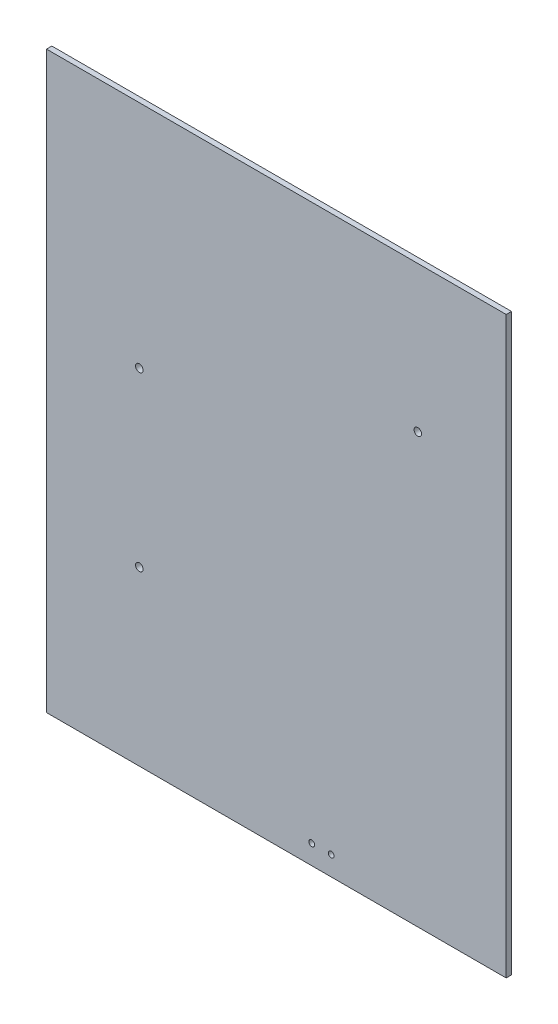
from build123d import *

# Parameters (mm, degrees)
ESQUISSE1_W             = 520
ESQUISSE1_H             = 650
BASE_EXTRUSION_DEPTH    = 6
ENL_V_MAT_EXTRU_1_REACH = 834.428
ESQUISSE2_R             = 4.25
ENL_V_MAT_EXTRU_2_REACH = 834.428
ESQUISSE3_R             = 3.25


with BuildPart() as part:
    # Esquisse1 → Base-Extrusion (new body)
    with BuildSketch(Plane.XY):
        with Locations((260, 325)):
            Rectangle(ESQUISSE1_W, ESQUISSE1_H)
    extrude(amount=BASE_EXTRUSION_DEPTH)

    # Esquisse2 → Enl_v. mat.-Extru.1 (cut, up to next)
    with BuildSketch(Plane.XY.offset(6), mode=Mode.PRIVATE) as enl_v_mat_extru_1_sk1:
        with Locations((420, 485)):
            Circle(ESQUISSE2_R)
    enl_v_mat_extru_1_tool1 = extrude(enl_v_mat_extru_1_sk1.sketch, amount=-ENL_V_MAT_EXTRU_1_REACH, mode=Mode.PRIVATE) & part.part
    # Esquisse2 → Enl_v. mat.-Extru.1 (cut, up to next)
    with BuildSketch(Plane.XY.offset(6), mode=Mode.PRIVATE) as enl_v_mat_extru_1_sk2:
        with Locations((105, 390)):
            Circle(ESQUISSE2_R)
    enl_v_mat_extru_1_tool2 = extrude(enl_v_mat_extru_1_sk2.sketch, amount=-ENL_V_MAT_EXTRU_1_REACH, mode=Mode.PRIVATE) & part.part
    # Esquisse2 → Enl_v. mat.-Extru.1 (cut, up to next)
    with BuildSketch(Plane.XY.offset(6), mode=Mode.PRIVATE) as enl_v_mat_extru_1_sk3:
        with Locations((105, 195)):
            Circle(ESQUISSE2_R)
    enl_v_mat_extru_1_tool3 = extrude(enl_v_mat_extru_1_sk3.sketch, amount=-ENL_V_MAT_EXTRU_1_REACH, mode=Mode.PRIVATE) & part.part
    add(enl_v_mat_extru_1_tool1.solids().sort_by_distance((420, 485, 6))[0], mode=Mode.SUBTRACT)
    add(enl_v_mat_extru_1_tool2.solids().sort_by_distance((105, 390, 6))[0], mode=Mode.SUBTRACT)
    add(enl_v_mat_extru_1_tool3.solids().sort_by_distance((105, 195, 6))[0], mode=Mode.SUBTRACT)

    # Esquisse3 → Enl_v. mat.-Extru.2 (cut, up to next)
    with BuildSketch(Plane.XY.offset(6), mode=Mode.PRIVATE) as enl_v_mat_extru_2_sk1:
        with Locations((300, 22)):
            Circle(ESQUISSE3_R)
    enl_v_mat_extru_2_tool1 = extrude(enl_v_mat_extru_2_sk1.sketch, amount=-ENL_V_MAT_EXTRU_2_REACH, mode=Mode.PRIVATE) & part.part
    # Esquisse3 → Enl_v. mat.-Extru.2 (cut, up to next)
    with BuildSketch(Plane.XY.offset(6), mode=Mode.PRIVATE) as enl_v_mat_extru_2_sk2:
        with Locations((322, 22)):
            Circle(ESQUISSE3_R)
    enl_v_mat_extru_2_tool2 = extrude(enl_v_mat_extru_2_sk2.sketch, amount=-ENL_V_MAT_EXTRU_2_REACH, mode=Mode.PRIVATE) & part.part
    add(enl_v_mat_extru_2_tool1.solids().sort_by_distance((300, 22, 6))[0], mode=Mode.SUBTRACT)
    add(enl_v_mat_extru_2_tool2.solids().sort_by_distance((322, 22, 6))[0], mode=Mode.SUBTRACT)


solid = part.part
